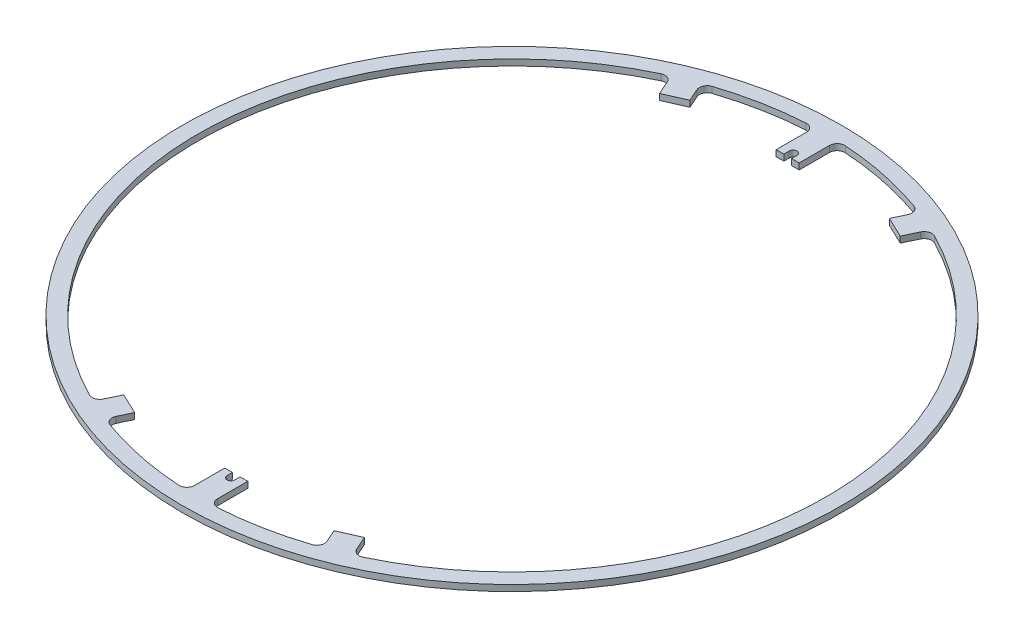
from build123d import *

# Parameters (mm, degrees)
SKETCH_1_R          = 43
SKETCH_1_R_2        = 41
EXTRUDE_1_DEPTH     = 0.8
EXTRUDE_START       = -0.8
EXTRUDE_2_DEPTH     = 0.8
FILLET_1_R          = 1
FILLET_2_R          = 1
CUT_EXTRUDE_1_DEPTH = 61.816445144
EXTRUDE_3_DEPTH     = 0.8
FILLET_3_R          = 1
EXTRUDE_4_DEPTH     = 0.8
FILLET_4_R          = 1
FILLET_5_R          = 1


with BuildPart() as part:
    # Sketch 1 → Extrude 1 (new body)
    with BuildSketch(Plane(origin=(0, 0, 0), x_dir=(1, 0, 0), z_dir=(0, 1, 0))):
        with Locations(Location((0, 0, 0), (0, 0, 270))):
            Circle(SKETCH_1_R)
        with Locations(Location((0, 0, 0), (0, 0, 270))):
            Circle(SKETCH_1_R_2, mode=Mode.SUBTRACT)
    extrude(amount=EXTRUDE_1_DEPTH)

    # Sketch 2 → Extrude 2 (add)
    with BuildSketch(Plane(origin=(0, 0.8, 0), x_dir=(1, 0, 0), z_dir=(0, 1, 0)).offset(EXTRUDE_START)):
        with BuildLine():
            Line((-1.5, -35.972551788), (-1.5, -40.972551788))
            ThreePointArc((-1.5, -40.972551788), (0, -41), (1.5, -40.972551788))
            Line((1.5, -40.972551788), (1.5, -35.972551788))
            Line((1.5, -35.972551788), (-1.5, -35.972551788))
        make_face()
        with BuildLine():
            ThreePointArc((1.5, 40.972551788), (0, 41), (-1.5, 40.972551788))
            Line((-1.5, 40.972551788), (-1.5, 35.972551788))
            Line((-1.5, 35.972551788), (1.5, 35.972551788))
            Line((1.5, 35.972551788), (1.5, 40.972551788))
        make_face()
    extrude(amount=EXTRUDE_2_DEPTH)

    # Fillet 1
    fillet_1_edges = [part.edges().sort_by_distance(p)[0] for p in [
        (-1.5, 0.4, -40.972551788),
        (1.5, 0.4, -40.972551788),
    ]]
    fillet(fillet_1_edges, radius=FILLET_1_R)

    # Fillet 2
    fillet_2_edges = [part.edges().sort_by_distance(p)[0] for p in [
        (-1.5, 0.4, 40.972551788),
        (1.5, 0.4, 40.972551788),
    ]]
    fillet(fillet_2_edges, radius=FILLET_2_R)

    # Sketch 3 → Cut-Extrude 1 (cut, through all)
    with BuildSketch(Plane.XZ):
        with BuildLine():
            Line((-0.5, 36.672551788), (-0.5, 33.672551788))
            Line((-0.5, 33.672551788), (0.5, 33.672551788))
            Line((0.5, 33.672551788), (0.5, 36.672551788))
            ThreePointArc((0.5, 36.672551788), (0, 37.172551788), (-0.5, 36.672551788))
        make_face()
        with BuildLine():
            Line((0.5, -33.672551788), (0.5, -36.672551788))
            ThreePointArc((0.5, -36.672551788), (0, -37.172551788), (-0.5, -36.672551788))
            Line((-0.5, -36.672551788), (-0.5, -33.672551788))
            Line((-0.5, -33.672551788), (0.5, -33.672551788))
        make_face()
    extrude(amount=-CUT_EXTRUDE_1_DEPTH, mode=Mode.SUBTRACT)

    # Sketch 4 → Extrude 3 (add)
    with BuildSketch(Plane(origin=(0, 0.8, 0), x_dir=(1, 0, 0), z_dir=(0, 1, 0)).offset(EXTRUDE_START)):
        with BuildLine():
            Line((-17.650954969, -37.005996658), (-16.359421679, -34.298240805))
            Line((-16.359421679, -34.298240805), (-13.651665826, -35.589774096))
            Line((-13.651665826, -35.589774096), (-14.895884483, -38.198332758))
            ThreePointArc((-14.895884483, -38.198332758), (-16.284336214, -37.627388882), (-17.650954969, -37.005996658))
        make_face()
        with BuildLine():
            Line((17.650954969, 37.005996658), (16.359421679, 34.298240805))
            Line((16.359421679, 34.298240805), (13.651665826, 35.589774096))
            Line((13.651665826, 35.589774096), (14.895884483, 38.198332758))
            ThreePointArc((14.895884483, 38.198332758), (16.284336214, 37.627388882), (17.650954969, 37.005996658))
        make_face()
    extrude(amount=EXTRUDE_3_DEPTH)

    # Fillet 3
    fillet_3_edges = [part.edges().sort_by_distance(p)[0] for p in [
        (-14.895884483, 0.4, 38.198332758),
        (-17.650954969, 0.4, 37.005996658),
        (14.895884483, 0.4, -38.198332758),
        (17.650954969, 0.4, -37.005996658),
    ]]
    fillet(fillet_3_edges, radius=FILLET_3_R)

    # Sketch 5 → Extrude 4 (add)
    with BuildSketch(Plane.XZ):
        with BuildLine():
            Line((16.676202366, 37.455363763), (15.455992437, 34.71472739))
            Line((15.455992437, 34.71472739), (12.715356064, 35.93493732))
            Line((12.715356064, 35.93493732), (13.890864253, 38.575171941))
            ThreePointArc((13.890864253, 38.575171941), (15.293785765, 38.040769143), (16.676202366, 37.455363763))
        make_face()
        with BuildLine():
            Line((-12.715356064, -35.93493732), (-13.890864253, -38.575171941))
            ThreePointArc((-13.890864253, -38.575171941), (-15.293785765, -38.040769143), (-16.676202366, -37.455363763))
            Line((-16.676202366, -37.455363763), (-15.455992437, -34.71472739))
            Line((-15.455992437, -34.71472739), (-12.715356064, -35.93493732))
        make_face()
    extrude(amount=-EXTRUDE_4_DEPTH)

    # Fillet 4
    fillet_4_edges = [part.edges().sort_by_distance(p)[0] for p in [
        (16.676202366, 0.4, 37.455363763),
        (13.890864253, 0.4, 38.575171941),
    ]]
    fillet(fillet_4_edges, radius=FILLET_4_R)

    # Fillet 5
    fillet_5_edges = [part.edges().sort_by_distance(p)[0] for p in [
        (-16.676202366, 0.4, -37.455363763),
        (-13.890864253, 0.4, -38.575171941),
    ]]
    fillet(fillet_5_edges, radius=FILLET_5_R)


solid = part.part
